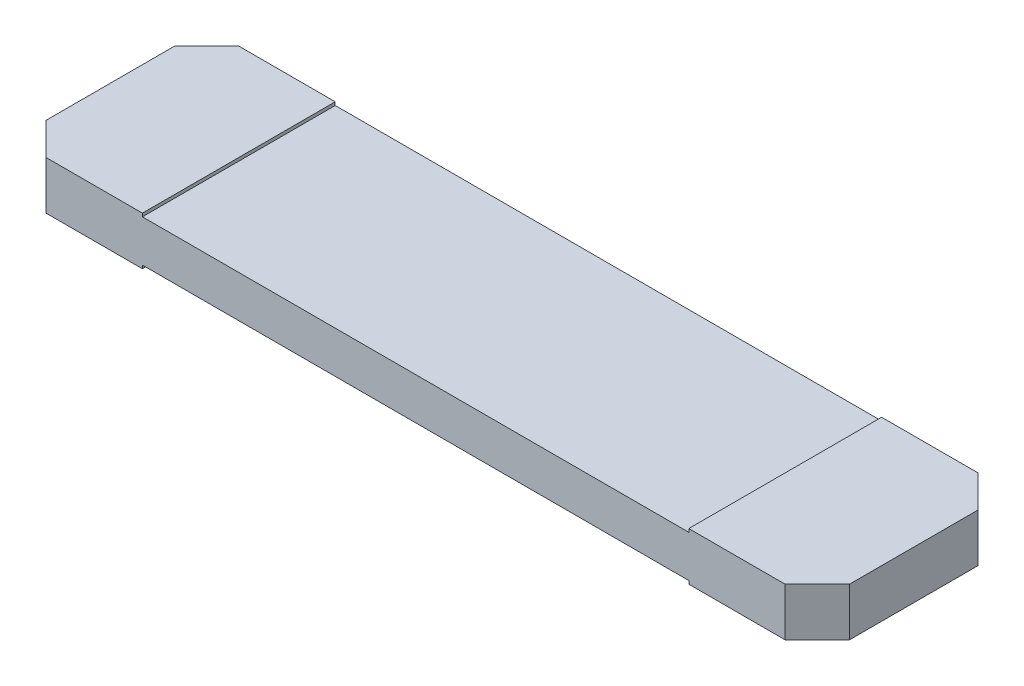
from build123d import *

# Parameters (mm, degrees)
EXTRUSION1_DEPTH        = 0.75
ESQUISSE2_W             = 17
ESQUISSE2_H             = 2
ENL_V_MAT_EXTRU_1_DEPTH = 10.75


with BuildPart() as part:
    # Esquisse1 → Extrusion1 (new, symmetric)
    with BuildSketch(Plane(origin=(0, 0, 0), x_dir=(1, 0, 0), z_dir=(0, 1, 0))):
        Polygon((-12.5, 2), (-11.5, 3), (11.5, 3), (12.5, 2), (12.5, -2), (11.5, -3), (-11.5, -3), (-12.5, -2), align=None)
    extrude(amount=EXTRUSION1_DEPTH, both=True)

    # Esquisse2 → Enl_v. mat.-Extru.1 (cut, symmetric)
    with BuildSketch(Plane.XY):
        with Locations((0, 1.65)):
            Rectangle(ESQUISSE2_W, ESQUISSE2_H)
        with Locations((0, -1.65)):
            Rectangle(ESQUISSE2_W, ESQUISSE2_H)
    extrude(amount=ENL_V_MAT_EXTRU_1_DEPTH, both=True, mode=Mode.SUBTRACT)


solid = part.part
